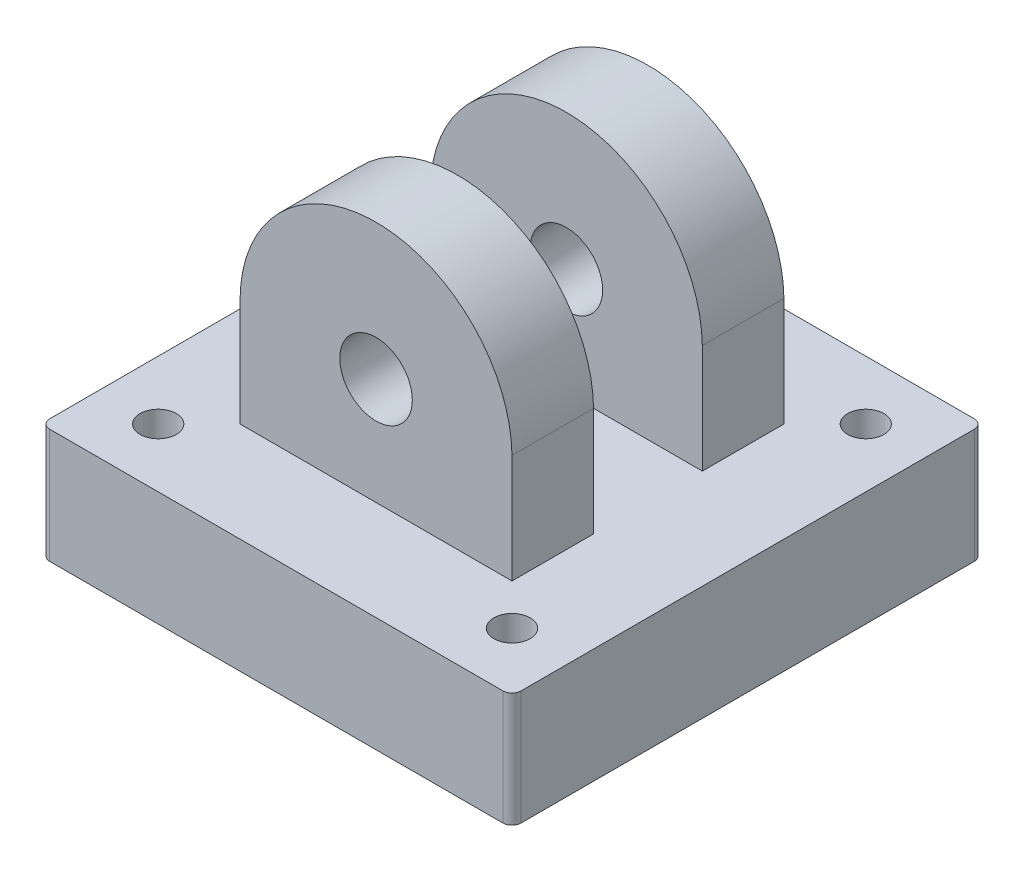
from build123d import *

# Parameters (mm, degrees)
BOSS_EXTRUDE1_DEPTH                    = 38.1
BOSS_EXTRUDE1_DEPTH_BACK               = 2
SKETCH1_W                              = 165.1
SKETCH1_H                              = 165.1
SKETCH2_W                              = 95.25
SKETCH2_H                              = 95.25
BOSS_EXTRUDE2_DEPTH                    = 38.1
BOSS_EXTRUDE3_DEPTH                    = 95.25
SKETCH6_R                              = 12.7
CUT_EXTRUDE1_DEPTH                     = 198.290297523
SKETCH7_W                              = 38.1
SKETCH7_H                              = 85.0398732
CUT_EXTRUDE2_DEPTH                     = 198.290297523
FILLET1_R                              = 3.175
SKETCH8_R                              = 26
CUT_EXTRUDE3_DEPTH                     = 36.83
SKETCH9_R                              = 76.2
SKETCH9_R_2                            = 69.85
CUT_EXTRUDE4_DEPTH                     = 8
F_1_2_14_NPSM_TAPPED_HOLE1_D           = 18.9738
F_1_2_14_NPSM_TAPPED_HOLE1_DEPTH       = 63.53
F_1_2_14_NPSM_TAPPED_HOLE1_CSINK_D     = 22.1742
F_1_2_14_NPSM_TAPPED_HOLE1_CSINK_ANGLE = 90
F_1_2_14_NPSM_TAPPED_HOLE1_TIP         = 5.700304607
SKETCH14_R                             = 6.35
CUT_EXTRUDE5_DEPTH                     = 25
SKETCH15_R                             = 6.35
CUT_EXTRUDE6_DEPTH                     = 172.14027248


with BuildPart() as part:
    # Sketch1 → Boss-Extrude1 (new, two sides: drawn at the far end of the back side and taken through both)
    with BuildSketch(Plane(origin=(0, 0, 0), x_dir=(1, 0, 0), z_dir=(0, 1, 0)).offset(-BOSS_EXTRUDE1_DEPTH_BACK)):
        Rectangle(SKETCH1_W, SKETCH1_H)
    extrude(amount=BOSS_EXTRUDE1_DEPTH + BOSS_EXTRUDE1_DEPTH_BACK)

    # Sketch2 → Boss-Extrude2 (add)
    with BuildSketch(Plane(origin=(0, 38.1, 0), x_dir=(1, 0, 0), z_dir=(0, 1, 0))):
        Rectangle(SKETCH2_W, SKETCH2_H)
    extrude(amount=BOSS_EXTRUDE2_DEPTH)

    # Sketch3 → Boss-Extrude3 (add)
    with BuildSketch(Plane.XY.offset(47.625)):
        with BuildLine():
            Line((-47.625, 76.2), (47.625, 76.2))
            ThreePointArc((47.625, 76.2), (0, 123.1398732), (-47.625, 76.2))
        make_face()
    extrude(amount=-BOSS_EXTRUDE3_DEPTH)

    # Sketch6 → Cut-Extrude1 (cut, through all)
    with BuildSketch(Plane.XY.offset(47.625)):
        with Locations((0, 75.5098732)):
            Circle(SKETCH6_R)
    extrude(amount=-CUT_EXTRUDE1_DEPTH, mode=Mode.SUBTRACT)

    # Sketch7 → Cut-Extrude2 (cut, through all)
    with BuildSketch(Plane.ZY.offset(47.625)):
        with Locations((0.005, 80.6199366)):
            Rectangle(SKETCH7_W, SKETCH7_H)
    extrude(amount=-CUT_EXTRUDE2_DEPTH, mode=Mode.SUBTRACT)

    # Fillet1
    fillet1_edges = [part.edges().sort_by_distance(p)[0] for p in [
        (82.55, 18.05, 82.55),
        (-82.55, 18.05, 82.55),
        (-82.55, 18.05, -82.55),
        (82.55, 18.05, -82.55),
    ]]
    fillet(fillet1_edges, radius=FILLET1_R)

    # Sketch8 → Cut-Extrude3 (cut)
    with BuildSketch(Plane.XZ.offset(2)):
        with Locations(Location((0, 0, 0), (0, 0, 270))):
            Circle(SKETCH8_R)
    extrude(amount=-CUT_EXTRUDE3_DEPTH, mode=Mode.SUBTRACT)

    # Sketch9 → Cut-Extrude4 (cut)
    with BuildSketch(Plane.XZ.offset(2)):
        with Locations(Location((0, 0, 0), (0, 0, 270))):
            Circle(SKETCH9_R)
        with Locations(Location((0, 0, 0), (0, 0, 270))):
            Circle(SKETCH9_R_2, mode=Mode.SUBTRACT)
    extrude(amount=-CUT_EXTRUDE4_DEPTH, mode=Mode.SUBTRACT)

    # 1_2-14 NPSM Tapped Hole1
    with Locations(Plane(origin=(-82.55, 18.05, 0), x_dir=(0, 0, -1), z_dir=(-1, 0, 0))):
        with Locations((0, 0)):
            CounterSinkHole(F_1_2_14_NPSM_TAPPED_HOLE1_D / 2, F_1_2_14_NPSM_TAPPED_HOLE1_CSINK_D / 2, depth=F_1_2_14_NPSM_TAPPED_HOLE1_DEPTH, counter_sink_angle=F_1_2_14_NPSM_TAPPED_HOLE1_CSINK_ANGLE)
            with Locations((0, 0, -(F_1_2_14_NPSM_TAPPED_HOLE1_DEPTH + F_1_2_14_NPSM_TAPPED_HOLE1_TIP / 2))):  # 118° drill point
                Cone(0, F_1_2_14_NPSM_TAPPED_HOLE1_D / 2, F_1_2_14_NPSM_TAPPED_HOLE1_TIP, mode=Mode.SUBTRACT)

    # Sketch14 → Cut-Extrude5 (cut)
    with BuildSketch(Plane.XZ.offset(2)):
        with Locations(Location((-50.55, 0, 0), (0, 0, 270))):
            Circle(SKETCH14_R)
    extrude(amount=-CUT_EXTRUDE5_DEPTH, mode=Mode.SUBTRACT)

    # Sketch15 → Cut-Extrude6 (cut, through all)
    with BuildSketch(Plane.XZ.offset(2)):
        with Locations(Location((-61.963767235, 61.963767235, 0), (0, 0, 270))):
            Circle(SKETCH15_R)
        with Locations(Location((61.963767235, 61.963767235, 0), (0, 0, 270))):
            Circle(SKETCH15_R)
        with Locations(Location((61.963767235, -61.963767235, 0), (0, 0, 270))):
            Circle(SKETCH15_R)
        with Locations(Location((-61.963767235, -61.963767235, 0), (0, 0, 270))):
            Circle(SKETCH15_R)
    extrude(amount=-CUT_EXTRUDE6_DEPTH, mode=Mode.SUBTRACT)


solid = part.part
